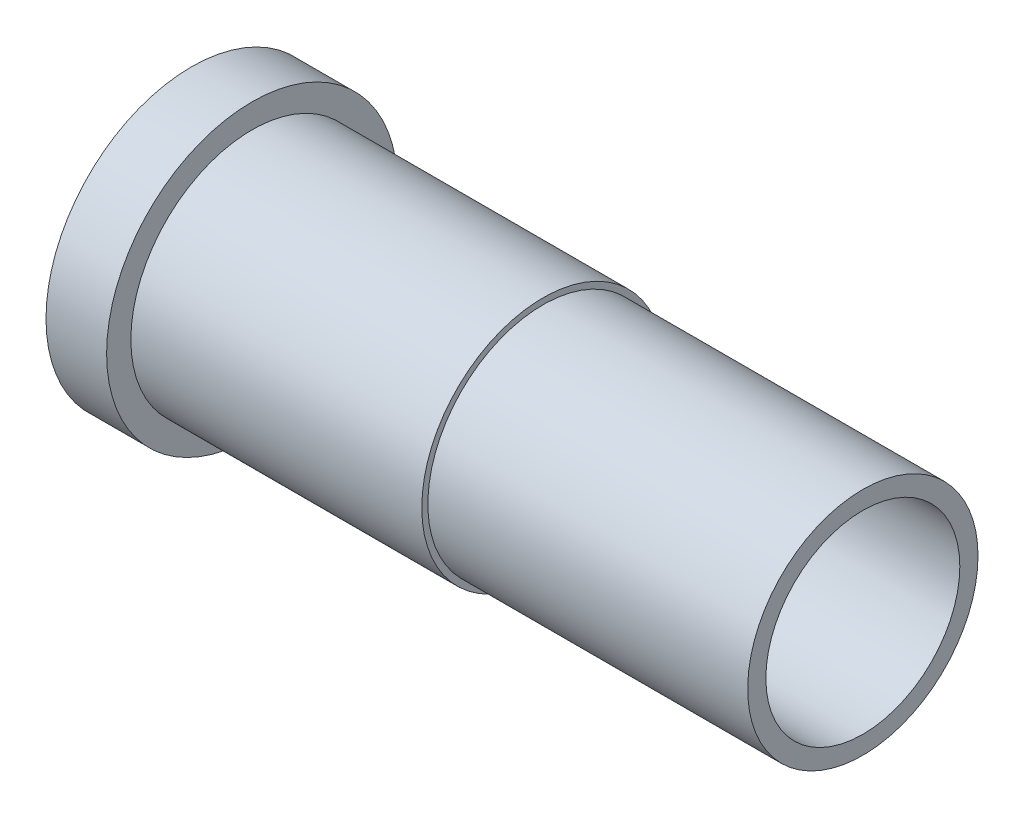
ISO-10303-21;
HEADER;
FILE_DESCRIPTION(('STEP AP214'),'2;1');
FILE_NAME('part.step','',(''),(''),'','','');
FILE_SCHEMA(('AUTOMOTIVE_DESIGN { 1 0 10303 214 1 1 1 1 }'));
ENDSEC;
DATA;
#1=APPLICATION_CONTEXT('core data for automotive mechanical design processes');
#2=APPLICATION_PROTOCOL_DEFINITION('international standard','automotive_design',2000,#1);
#3=PRODUCT_CONTEXT('',#1,'mechanical');
#4=PRODUCT('Part','Part','',(#3));
#5=PRODUCT_RELATED_PRODUCT_CATEGORY('part','',(#4));
#6=PRODUCT_DEFINITION_FORMATION('','',#4);
#7=PRODUCT_DEFINITION_CONTEXT('part definition',#1,'design');
#8=PRODUCT_DEFINITION('design','',#6,#7);
#9=PRODUCT_DEFINITION_SHAPE('','',#8);
#10=(LENGTH_UNIT() NAMED_UNIT(*) SI_UNIT(.MILLI.,.METRE.));
#11=(NAMED_UNIT(*) PLANE_ANGLE_UNIT() SI_UNIT($,.RADIAN.));
#12=(NAMED_UNIT(*) SI_UNIT($,.STERADIAN.) SOLID_ANGLE_UNIT());
#13=UNCERTAINTY_MEASURE_WITH_UNIT(LENGTH_MEASURE(1.E-05),#10,'distance_accuracy_value','');
#14=(GEOMETRIC_REPRESENTATION_CONTEXT(3) GLOBAL_UNCERTAINTY_ASSIGNED_CONTEXT((#13)) GLOBAL_UNIT_ASSIGNED_CONTEXT((#10,
#11,#12)) REPRESENTATION_CONTEXT('',''));
#15=CARTESIAN_POINT('',(0.,0.,0.));
#16=DIRECTION('',(0.,0.,1.));
#17=DIRECTION('',(1.,0.,0.));
#18=AXIS2_PLACEMENT_3D('',#15,#16,#17);
#19=CARTESIAN_POINT('',(-21.6393356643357,0.,0.));
#20=DIRECTION('',(-1.,0.,0.));
#21=DIRECTION('',(0.,0.,1.));
#22=AXIS2_PLACEMENT_3D('',#19,#20,#21);
#23=CYLINDRICAL_SURFACE('',#22,8.);
#24=CARTESIAN_POINT('',(0.5,0.,0.));
#25=DIRECTION('',(1.,0.,0.));
#26=DIRECTION('',(0.,0.,-1.));
#27=AXIS2_PLACEMENT_3D('',#24,#25,#26);
#28=CIRCLE('',#27,8.);
#29=CARTESIAN_POINT('',(0.5,0.,-8.));
#30=VERTEX_POINT('',#29);
#31=EDGE_CURVE('E40',#30,#30,#28,.F.);
#32=ORIENTED_EDGE('',*,*,#31,.T.);
#33=EDGE_LOOP('',(#32));
#34=FACE_BOUND('',#33,.T.);
#35=CARTESIAN_POINT('',(55.383,0.,0.));
#36=DIRECTION('',(1.,0.,0.));
#37=DIRECTION('',(0.,1.,0.));
#38=AXIS2_PLACEMENT_3D('',#35,#36,#37);
#39=CIRCLE('',#38,8.);
#40=CARTESIAN_POINT('',(55.383,8.,0.));
#41=VERTEX_POINT('',#40);
#42=EDGE_CURVE('E58',#41,#41,#39,.F.);
#43=ORIENTED_EDGE('',*,*,#42,.F.);
#44=EDGE_LOOP('',(#43));
#45=FACE_BOUND('',#44,.T.);
#46=ADVANCED_FACE('F32',(#34,#45),#23,.F.);
#47=CARTESIAN_POINT('',(29.,0.,0.));
#48=DIRECTION('',(1.,0.,0.));
#49=DIRECTION('',(0.,0.,-1.));
#50=AXIS2_PLACEMENT_3D('',#47,#48,#49);
#51=CYLINDRICAL_SURFACE('',#50,9.5);
#52=CARTESIAN_POINT('',(29.,0.,0.));
#53=DIRECTION('',(1.,0.,0.));
#54=DIRECTION('',(0.,0.,-1.));
#55=AXIS2_PLACEMENT_3D('',#52,#53,#54);
#56=CIRCLE('',#55,9.5);
#57=CARTESIAN_POINT('',(29.,0.,-9.5));
#58=VERTEX_POINT('',#57);
#59=EDGE_CURVE('E55',#58,#58,#56,.T.);
#60=ORIENTED_EDGE('',*,*,#59,.T.);
#61=EDGE_LOOP('',(#60));
#62=FACE_BOUND('',#61,.T.);
#63=CARTESIAN_POINT('',(55.383,0.,0.));
#64=DIRECTION('',(1.,0.,0.));
#65=DIRECTION('',(0.,1.,0.));
#66=AXIS2_PLACEMENT_3D('',#63,#64,#65);
#67=CIRCLE('',#66,9.5);
#68=CARTESIAN_POINT('',(55.383,9.5,0.));
#69=VERTEX_POINT('',#68);
#70=EDGE_CURVE('E61',#69,#69,#67,.F.);
#71=ORIENTED_EDGE('',*,*,#70,.T.);
#72=EDGE_LOOP('',(#71));
#73=FACE_BOUND('',#72,.T.);
#74=ADVANCED_FACE('F65',(#62,#73),#51,.T.);
#75=CARTESIAN_POINT('',(-21.6393356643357,0.,0.));
#76=DIRECTION('',(-1.,0.,0.));
#77=DIRECTION('',(0.,0.,1.));
#78=AXIS2_PLACEMENT_3D('',#75,#76,#77);
#79=CYLINDRICAL_SURFACE('',#78,10.);
#80=CARTESIAN_POINT('',(5.,0.,0.));
#81=DIRECTION('',(-1.,0.,0.));
#82=DIRECTION('',(0.,0.,1.));
#83=AXIS2_PLACEMENT_3D('',#80,#81,#82);
#84=CIRCLE('',#83,10.);
#85=CARTESIAN_POINT('',(5.,0.,10.));
#86=VERTEX_POINT('',#85);
#87=EDGE_CURVE('E52',#86,#86,#84,.T.);
#88=ORIENTED_EDGE('',*,*,#87,.F.);
#89=EDGE_LOOP('',(#88));
#90=FACE_BOUND('',#89,.T.);
#91=CARTESIAN_POINT('',(29.,0.,0.));
#92=DIRECTION('',(1.,0.,0.));
#93=DIRECTION('',(0.,0.,-1.));
#94=AXIS2_PLACEMENT_3D('',#91,#92,#93);
#95=CIRCLE('',#94,10.);
#96=CARTESIAN_POINT('',(29.,0.,-10.));
#97=VERTEX_POINT('',#96);
#98=EDGE_CURVE('E36',#97,#97,#95,.T.);
#99=ORIENTED_EDGE('',*,*,#98,.F.);
#100=EDGE_LOOP('',(#99));
#101=FACE_BOUND('',#100,.T.);
#102=ADVANCED_FACE('F79',(#90,#101),#79,.T.);
#103=CARTESIAN_POINT('',(0.,7.99999999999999,0.));
#104=DIRECTION('',(1.,0.,0.));
#105=DIRECTION('',(0.,0.,-1.));
#106=AXIS2_PLACEMENT_3D('',#103,#104,#105);
#107=PLANE('',#106);
#108=CARTESIAN_POINT('',(0.,0.,0.));
#109=DIRECTION('',(1.,0.,0.));
#110=DIRECTION('',(0.,0.,-1.));
#111=AXIS2_PLACEMENT_3D('',#108,#109,#110);
#112=CIRCLE('',#111,8.5);
#113=CARTESIAN_POINT('',(0.,0.,-8.5));
#114=VERTEX_POINT('',#113);
#115=EDGE_CURVE('E11',#114,#114,#112,.T.);
#116=ORIENTED_EDGE('',*,*,#115,.T.);
#117=EDGE_LOOP('',(#116));
#118=FACE_BOUND('',#117,.T.);
#119=CARTESIAN_POINT('',(0.,0.,0.));
#120=DIRECTION('',(-1.,0.,0.));
#121=DIRECTION('',(0.,0.,1.));
#122=AXIS2_PLACEMENT_3D('',#119,#120,#121);
#123=CIRCLE('',#122,12.);
#124=CARTESIAN_POINT('',(0.,0.,12.));
#125=VERTEX_POINT('',#124);
#126=EDGE_CURVE('E44',#125,#125,#123,.T.);
#127=ORIENTED_EDGE('',*,*,#126,.T.);
#128=EDGE_LOOP('',(#127));
#129=FACE_BOUND('',#128,.T.);
#130=ADVANCED_FACE('F83',(#118,#129),#107,.F.);
#131=CARTESIAN_POINT('',(-21.6393356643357,0.,0.));
#132=DIRECTION('',(-1.,0.,0.));
#133=DIRECTION('',(0.,0.,1.));
#134=AXIS2_PLACEMENT_3D('',#131,#132,#133);
#135=CYLINDRICAL_SURFACE('',#134,12.);
#136=ORIENTED_EDGE('',*,*,#126,.F.);
#137=EDGE_LOOP('',(#136));
#138=FACE_BOUND('',#137,.T.);
#139=CARTESIAN_POINT('',(5.,0.,0.));
#140=DIRECTION('',(-1.,0.,0.));
#141=DIRECTION('',(0.,0.,1.));
#142=AXIS2_PLACEMENT_3D('',#139,#140,#141);
#143=CIRCLE('',#142,12.);
#144=CARTESIAN_POINT('',(5.,0.,12.));
#145=VERTEX_POINT('',#144);
#146=EDGE_CURVE('E49',#145,#145,#143,.T.);
#147=ORIENTED_EDGE('',*,*,#146,.T.);
#148=EDGE_LOOP('',(#147));
#149=FACE_BOUND('',#148,.T.);
#150=ADVANCED_FACE('F86',(#138,#149),#135,.T.);
#151=CARTESIAN_POINT('',(5.,12.,0.));
#152=DIRECTION('',(-1.,0.,0.));
#153=DIRECTION('',(0.,0.,1.));
#154=AXIS2_PLACEMENT_3D('',#151,#152,#153);
#155=PLANE('',#154);
#156=ORIENTED_EDGE('',*,*,#146,.F.);
#157=EDGE_LOOP('',(#156));
#158=FACE_BOUND('',#157,.T.);
#159=ORIENTED_EDGE('',*,*,#87,.T.);
#160=EDGE_LOOP('',(#159));
#161=FACE_BOUND('',#160,.T.);
#162=ADVANCED_FACE('F89',(#158,#161),#155,.F.);
#163=CARTESIAN_POINT('',(0.5,0.,0.));
#164=DIRECTION('',(-1.,0.,0.));
#165=DIRECTION('',(0.,0.,1.));
#166=AXIS2_PLACEMENT_3D('',#163,#164,#165);
#167=CONICAL_SURFACE('',#166,8.,0.785398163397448);
#168=ORIENTED_EDGE('',*,*,#115,.F.);
#169=EDGE_LOOP('',(#168));
#170=FACE_BOUND('',#169,.T.);
#171=ORIENTED_EDGE('',*,*,#31,.F.);
#172=EDGE_LOOP('',(#171));
#173=FACE_BOUND('',#172,.T.);
#174=ADVANCED_FACE('F34',(#170,#173),#167,.F.);
#175=CARTESIAN_POINT('',(29.,0.,0.));
#176=DIRECTION('',(1.,0.,0.));
#177=DIRECTION('',(0.,0.,-1.));
#178=AXIS2_PLACEMENT_3D('',#175,#176,#177);
#179=PLANE('',#178);
#180=ORIENTED_EDGE('',*,*,#59,.F.);
#181=EDGE_LOOP('',(#180));
#182=FACE_BOUND('',#181,.T.);
#183=ORIENTED_EDGE('',*,*,#98,.T.);
#184=EDGE_LOOP('',(#183));
#185=FACE_BOUND('',#184,.T.);
#186=ADVANCED_FACE('F70',(#182,#185),#179,.T.);
#187=CARTESIAN_POINT('',(55.383,-9.67099999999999,0.));
#188=DIRECTION('',(1.,0.,0.));
#189=DIRECTION('',(0.,0.,-1.));
#190=AXIS2_PLACEMENT_3D('',#187,#188,#189);
#191=PLANE('',#190);
#192=ORIENTED_EDGE('',*,*,#70,.F.);
#193=EDGE_LOOP('',(#192));
#194=FACE_BOUND('',#193,.T.);
#195=ORIENTED_EDGE('',*,*,#42,.T.);
#196=EDGE_LOOP('',(#195));
#197=FACE_BOUND('',#196,.T.);
#198=ADVANCED_FACE('F67',(#194,#197),#191,.T.);
#199=CLOSED_SHELL('',(#46,#74,#102,#130,#150,#162,#174,#186,#198));
#200=MANIFOLD_SOLID_BREP('B2',#199);
#201=ADVANCED_BREP_SHAPE_REPRESENTATION('',(#18,#200),#14);
#202=SHAPE_DEFINITION_REPRESENTATION(#9,#201);
ENDSEC;
END-ISO-10303-21;
